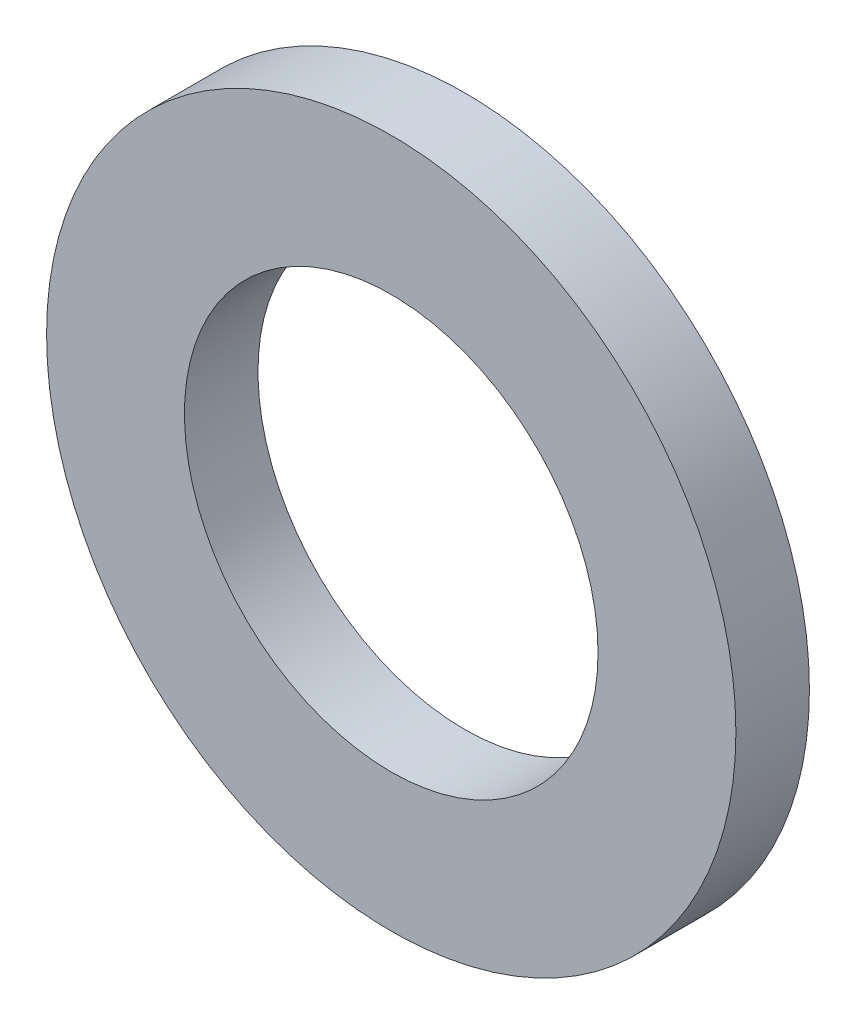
ISO-10303-21;
HEADER;
FILE_DESCRIPTION(('STEP AP214'),'2;1');
FILE_NAME('part.step','',(''),(''),'','','');
FILE_SCHEMA(('AUTOMOTIVE_DESIGN { 1 0 10303 214 1 1 1 1 }'));
ENDSEC;
DATA;
#1=APPLICATION_CONTEXT('core data for automotive mechanical design processes');
#2=APPLICATION_PROTOCOL_DEFINITION('international standard','automotive_design',2000,#1);
#3=PRODUCT_CONTEXT('',#1,'mechanical');
#4=PRODUCT('Part','Part','',(#3));
#5=PRODUCT_RELATED_PRODUCT_CATEGORY('part','',(#4));
#6=PRODUCT_DEFINITION_FORMATION('','',#4);
#7=PRODUCT_DEFINITION_CONTEXT('part definition',#1,'design');
#8=PRODUCT_DEFINITION('design','',#6,#7);
#9=PRODUCT_DEFINITION_SHAPE('','',#8);
#10=(LENGTH_UNIT() NAMED_UNIT(*) SI_UNIT(.MILLI.,.METRE.));
#11=(NAMED_UNIT(*) PLANE_ANGLE_UNIT() SI_UNIT($,.RADIAN.));
#12=(NAMED_UNIT(*) SI_UNIT($,.STERADIAN.) SOLID_ANGLE_UNIT());
#13=UNCERTAINTY_MEASURE_WITH_UNIT(LENGTH_MEASURE(1.E-05),#10,'distance_accuracy_value','');
#14=(GEOMETRIC_REPRESENTATION_CONTEXT(3) GLOBAL_UNCERTAINTY_ASSIGNED_CONTEXT((#13)) GLOBAL_UNIT_ASSIGNED_CONTEXT((#10,
#11,#12)) REPRESENTATION_CONTEXT('',''));
#15=CARTESIAN_POINT('',(0.,0.,0.));
#16=DIRECTION('',(0.,0.,1.));
#17=DIRECTION('',(1.,0.,0.));
#18=AXIS2_PLACEMENT_3D('',#15,#16,#17);
#19=CARTESIAN_POINT('',(0.,0.,3.2));
#20=DIRECTION('',(0.,0.,-1.));
#21=DIRECTION('',(1.,0.,0.));
#22=AXIS2_PLACEMENT_3D('',#19,#20,#21);
#23=PLANE('',#22);
#24=CARTESIAN_POINT('',(0.,0.,3.2));
#25=DIRECTION('',(0.,0.,-1.));
#26=DIRECTION('',(1.,0.,0.));
#27=AXIS2_PLACEMENT_3D('',#24,#25,#26);
#28=CIRCLE('',#27,15.);
#29=CARTESIAN_POINT('',(15.,0.,3.2));
#30=VERTEX_POINT('',#29);
#31=EDGE_CURVE('E19',#30,#30,#28,.T.);
#32=ORIENTED_EDGE('',*,*,#31,.F.);
#33=EDGE_LOOP('',(#32));
#34=FACE_BOUND('',#33,.T.);
#35=CARTESIAN_POINT('',(0.,0.,3.2));
#36=DIRECTION('',(0.,0.,-1.));
#37=DIRECTION('',(1.,0.,0.));
#38=AXIS2_PLACEMENT_3D('',#35,#36,#37);
#39=CIRCLE('',#38,9.);
#40=CARTESIAN_POINT('',(9.,0.,3.2));
#41=VERTEX_POINT('',#40);
#42=EDGE_CURVE('E23',#41,#41,#39,.T.);
#43=ORIENTED_EDGE('',*,*,#42,.T.);
#44=EDGE_LOOP('',(#43));
#45=FACE_BOUND('',#44,.T.);
#46=ADVANCED_FACE('F12',(#34,#45),#23,.F.);
#47=CARTESIAN_POINT('',(0.,0.,0.));
#48=DIRECTION('',(0.,0.,1.));
#49=DIRECTION('',(-1.,0.,0.));
#50=AXIS2_PLACEMENT_3D('',#47,#48,#49);
#51=CYLINDRICAL_SURFACE('',#50,9.);
#52=CARTESIAN_POINT('',(0.,0.,0.));
#53=DIRECTION('',(0.,0.,1.));
#54=DIRECTION('',(0.,-1.,0.));
#55=AXIS2_PLACEMENT_3D('',#52,#53,#54);
#56=CIRCLE('',#55,9.);
#57=CARTESIAN_POINT('',(0.,-9.,0.));
#58=VERTEX_POINT('',#57);
#59=EDGE_CURVE('E27',#58,#58,#56,.T.);
#60=ORIENTED_EDGE('',*,*,#59,.F.);
#61=EDGE_LOOP('',(#60));
#62=FACE_BOUND('',#61,.T.);
#63=ORIENTED_EDGE('',*,*,#42,.F.);
#64=EDGE_LOOP('',(#63));
#65=FACE_BOUND('',#64,.T.);
#66=ADVANCED_FACE('F35',(#62,#65),#51,.F.);
#67=CARTESIAN_POINT('',(0.,0.,0.));
#68=DIRECTION('',(0.,0.,1.));
#69=DIRECTION('',(-1.,0.,0.));
#70=AXIS2_PLACEMENT_3D('',#67,#68,#69);
#71=CYLINDRICAL_SURFACE('',#70,15.);
#72=CARTESIAN_POINT('',(0.,0.,0.));
#73=DIRECTION('',(0.,0.,-1.));
#74=DIRECTION('',(1.,0.,0.));
#75=AXIS2_PLACEMENT_3D('',#72,#73,#74);
#76=CIRCLE('',#75,15.);
#77=CARTESIAN_POINT('',(15.,0.,0.));
#78=VERTEX_POINT('',#77);
#79=EDGE_CURVE('E8',#78,#78,#76,.T.);
#80=ORIENTED_EDGE('',*,*,#79,.F.);
#81=EDGE_LOOP('',(#80));
#82=FACE_BOUND('',#81,.T.);
#83=ORIENTED_EDGE('',*,*,#31,.T.);
#84=EDGE_LOOP('',(#83));
#85=FACE_BOUND('',#84,.T.);
#86=ADVANCED_FACE('F14',(#82,#85),#71,.T.);
#87=CARTESIAN_POINT('',(0.,0.,0.));
#88=DIRECTION('',(0.,0.,-1.));
#89=DIRECTION('',(1.,0.,0.));
#90=AXIS2_PLACEMENT_3D('',#87,#88,#89);
#91=PLANE('',#90);
#92=ORIENTED_EDGE('',*,*,#79,.T.);
#93=EDGE_LOOP('',(#92));
#94=FACE_BOUND('',#93,.T.);
#95=ORIENTED_EDGE('',*,*,#59,.T.);
#96=EDGE_LOOP('',(#95));
#97=FACE_BOUND('',#96,.T.);
#98=ADVANCED_FACE('F33',(#94,#97),#91,.T.);
#99=CLOSED_SHELL('',(#46,#66,#86,#98));
#100=MANIFOLD_SOLID_BREP('B1',#99);
#101=ADVANCED_BREP_SHAPE_REPRESENTATION('',(#18,#100),#14);
#102=SHAPE_DEFINITION_REPRESENTATION(#9,#101);
ENDSEC;
END-ISO-10303-21;
